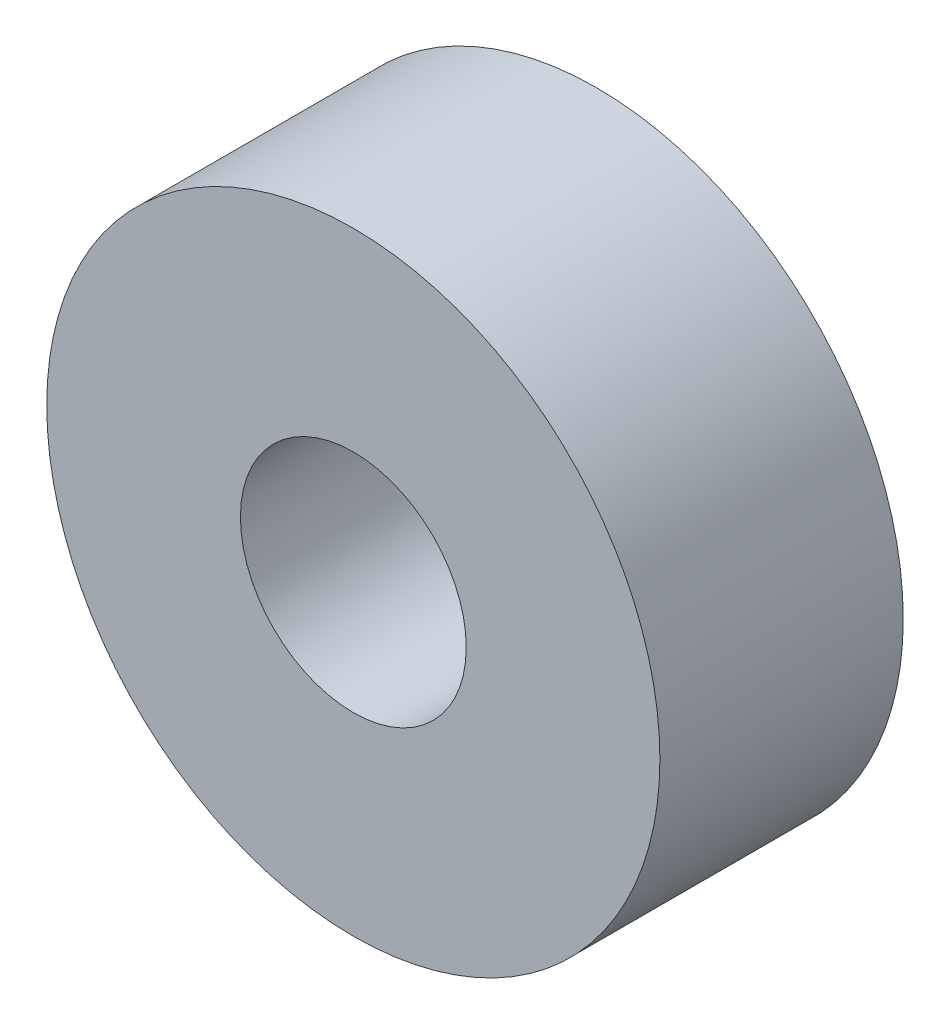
ISO-10303-21;
HEADER;
FILE_DESCRIPTION(('STEP AP214'),'2;1');
FILE_NAME('part.step','',(''),(''),'','','');
FILE_SCHEMA(('AUTOMOTIVE_DESIGN { 1 0 10303 214 1 1 1 1 }'));
ENDSEC;
DATA;
#1=APPLICATION_CONTEXT('core data for automotive mechanical design processes');
#2=APPLICATION_PROTOCOL_DEFINITION('international standard','automotive_design',2000,#1);
#3=PRODUCT_CONTEXT('',#1,'mechanical');
#4=PRODUCT('Part','Part','',(#3));
#5=PRODUCT_RELATED_PRODUCT_CATEGORY('part','',(#4));
#6=PRODUCT_DEFINITION_FORMATION('','',#4);
#7=PRODUCT_DEFINITION_CONTEXT('part definition',#1,'design');
#8=PRODUCT_DEFINITION('design','',#6,#7);
#9=PRODUCT_DEFINITION_SHAPE('','',#8);
#10=(LENGTH_UNIT() NAMED_UNIT(*) SI_UNIT(.MILLI.,.METRE.));
#11=(NAMED_UNIT(*) PLANE_ANGLE_UNIT() SI_UNIT($,.RADIAN.));
#12=(NAMED_UNIT(*) SI_UNIT($,.STERADIAN.) SOLID_ANGLE_UNIT());
#13=UNCERTAINTY_MEASURE_WITH_UNIT(LENGTH_MEASURE(1.E-05),#10,'distance_accuracy_value','');
#14=(GEOMETRIC_REPRESENTATION_CONTEXT(3) GLOBAL_UNCERTAINTY_ASSIGNED_CONTEXT((#13)) GLOBAL_UNIT_ASSIGNED_CONTEXT((#10,
#11,#12)) REPRESENTATION_CONTEXT('',''));
#15=CARTESIAN_POINT('',(0.,0.,0.));
#16=DIRECTION('',(0.,0.,1.));
#17=DIRECTION('',(1.,0.,0.));
#18=AXIS2_PLACEMENT_3D('',#15,#16,#17);
#19=CARTESIAN_POINT('',(0.,0.,3.175));
#20=DIRECTION('',(0.,0.,1.));
#21=DIRECTION('',(1.,0.,0.));
#22=AXIS2_PLACEMENT_3D('',#19,#20,#21);
#23=PLANE('',#22);
#24=CARTESIAN_POINT('',(0.,0.,3.175));
#25=DIRECTION('',(0.,0.,1.));
#26=DIRECTION('',(1.,0.,0.));
#27=AXIS2_PLACEMENT_3D('',#24,#25,#26);
#28=CIRCLE('',#27,4.);
#29=CARTESIAN_POINT('',(4.,0.,3.175));
#30=VERTEX_POINT('',#29);
#31=EDGE_CURVE('E10',#30,#30,#28,.T.);
#32=ORIENTED_EDGE('',*,*,#31,.T.);
#33=EDGE_LOOP('',(#32));
#34=FACE_BOUND('',#33,.T.);
#35=CARTESIAN_POINT('',(0.,0.,3.175));
#36=DIRECTION('',(0.,0.,1.));
#37=DIRECTION('',(1.,0.,0.));
#38=AXIS2_PLACEMENT_3D('',#35,#36,#37);
#39=CIRCLE('',#38,1.4732);
#40=CARTESIAN_POINT('',(1.4732,0.,3.175));
#41=VERTEX_POINT('',#40);
#42=EDGE_CURVE('E43',#41,#41,#39,.T.);
#43=ORIENTED_EDGE('',*,*,#42,.F.);
#44=EDGE_LOOP('',(#43));
#45=FACE_BOUND('',#44,.T.);
#46=ADVANCED_FACE('F32',(#34,#45),#23,.T.);
#47=CARTESIAN_POINT('',(0.,0.,0.));
#48=DIRECTION('',(0.,0.,1.));
#49=DIRECTION('',(1.,0.,0.));
#50=AXIS2_PLACEMENT_3D('',#47,#48,#49);
#51=PLANE('',#50);
#52=CARTESIAN_POINT('',(0.,0.,0.));
#53=DIRECTION('',(0.,0.,1.));
#54=DIRECTION('',(1.,0.,0.));
#55=AXIS2_PLACEMENT_3D('',#52,#53,#54);
#56=CIRCLE('',#55,4.);
#57=CARTESIAN_POINT('',(4.,0.,0.));
#58=VERTEX_POINT('',#57);
#59=EDGE_CURVE('E36',#58,#58,#56,.T.);
#60=ORIENTED_EDGE('',*,*,#59,.F.);
#61=EDGE_LOOP('',(#60));
#62=FACE_BOUND('',#61,.T.);
#63=CARTESIAN_POINT('',(0.,0.,0.));
#64=DIRECTION('',(0.,0.,1.));
#65=DIRECTION('',(1.,0.,0.));
#66=AXIS2_PLACEMENT_3D('',#63,#64,#65);
#67=CIRCLE('',#66,1.4732);
#68=CARTESIAN_POINT('',(1.4732,0.,0.));
#69=VERTEX_POINT('',#68);
#70=EDGE_CURVE('E45',#69,#69,#67,.T.);
#71=ORIENTED_EDGE('',*,*,#70,.T.);
#72=EDGE_LOOP('',(#71));
#73=FACE_BOUND('',#72,.T.);
#74=ADVANCED_FACE('F55',(#62,#73),#51,.F.);
#75=CARTESIAN_POINT('',(0.,0.,3.175));
#76=DIRECTION('',(0.,0.,-1.));
#77=DIRECTION('',(-1.,0.,0.));
#78=AXIS2_PLACEMENT_3D('',#75,#76,#77);
#79=CYLINDRICAL_SURFACE('',#78,4.);
#80=ORIENTED_EDGE('',*,*,#31,.F.);
#81=EDGE_LOOP('',(#80));
#82=FACE_BOUND('',#81,.T.);
#83=ORIENTED_EDGE('',*,*,#59,.T.);
#84=EDGE_LOOP('',(#83));
#85=FACE_BOUND('',#84,.T.);
#86=ADVANCED_FACE('F34',(#82,#85),#79,.T.);
#87=CARTESIAN_POINT('',(0.,0.,3.175));
#88=DIRECTION('',(0.,0.,-1.));
#89=DIRECTION('',(-1.,0.,0.));
#90=AXIS2_PLACEMENT_3D('',#87,#88,#89);
#91=CYLINDRICAL_SURFACE('',#90,1.4732);
#92=ORIENTED_EDGE('',*,*,#42,.T.);
#93=EDGE_LOOP('',(#92));
#94=FACE_BOUND('',#93,.T.);
#95=ORIENTED_EDGE('',*,*,#70,.F.);
#96=EDGE_LOOP('',(#95));
#97=FACE_BOUND('',#96,.T.);
#98=ADVANCED_FACE('F51',(#94,#97),#91,.F.);
#99=CLOSED_SHELL('',(#46,#74,#86,#98));
#100=MANIFOLD_SOLID_BREP('B2',#99);
#101=ADVANCED_BREP_SHAPE_REPRESENTATION('',(#18,#100),#14);
#102=SHAPE_DEFINITION_REPRESENTATION(#9,#101);
ENDSEC;
END-ISO-10303-21;
